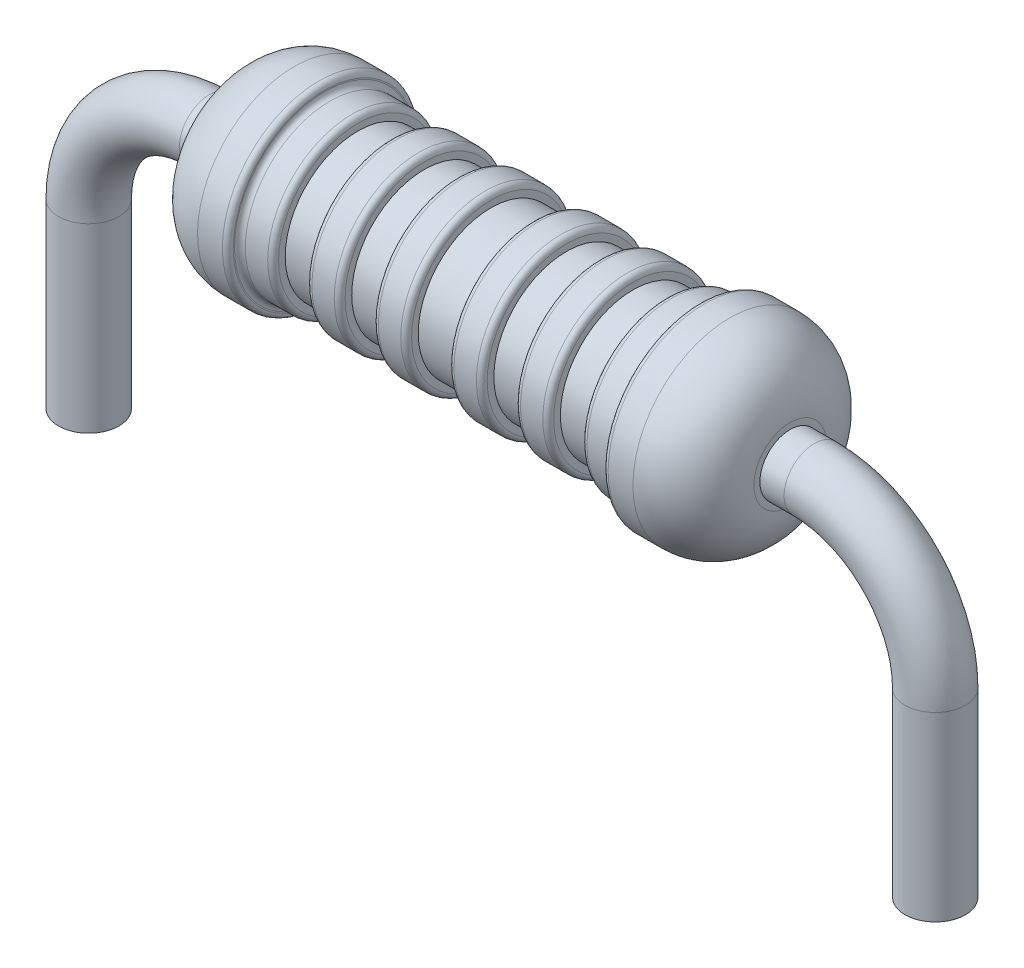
from build123d import *

# Parameters (mm, degrees)
SKETCH2_R = 0.5


with BuildPart() as part:
    # Sweep1: sweep along a path in Sketch3
    with BuildLine(Plane.XY) as sweep1_path:
        Line((7, 0), (7, 3))
        ThreePointArc((7, 3), (6.414213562, 4.414213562), (5, 5))
        Line((5, 5), (-5, 5))
        ThreePointArc((-5, 5), (-6.414213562, 4.414213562), (-7, 3))
        Line((-7, 3), (-7, 0))
    # Sketch2 → Sweep1 (sweep)
    with BuildSketch(Plane(origin=(0, 0, 0), x_dir=(1, 0, 0), z_dir=(0, 1, 0))):
        with Locations((-7, 0)):
            Circle(SKETCH2_R)
    sweep(path=sweep1_path.line)

    # Sketch4 → Revolve1 (revolve)
    with BuildSketch(Plane.XY, mode=Mode.PRIVATE) as revolve1_sk:
        with BuildLine():
            Line((-4.6, 5), (-4.6, 4.4))
            ThreePointArc((-4.6, 4.4), (-4.307106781, 3.692893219), (-3.6, 3.4))
            Line((-3.6, 3.4), (-3.19, 3.4))
            ThreePointArc((-3.19, 3.4), (-3.12636039, 3.42636039), (-3.1, 3.49))
            Line((-3.1, 3.49), (-3.1, 3.51))
            ThreePointArc((-3.1, 3.51), (-3.07363961, 3.57363961), (-3.01, 3.6))
            Line((-3.01, 3.6), (-2.64, 3.6))
            ThreePointArc((-2.64, 3.6), (-2.57636039, 3.62636039), (-2.55, 3.69))
            Line((-2.55, 3.69), (-2.55, 3.8))
            Line((-2.55, 3.8), (-2, 3.8))
            Line((-2, 3.8), (-2, 3.69))
            ThreePointArc((-2, 3.69), (-1.97363961, 3.62636039), (-1.91, 3.6))
            Line((-1.91, 3.6), (-1.54, 3.6))
            ThreePointArc((-1.54, 3.6), (-1.47636039, 3.62636039), (-1.45, 3.69))
            Line((-1.45, 3.69), (-1.45, 3.8))
            Line((-1.45, 3.8), (-0.9, 3.8))
            Line((-0.9, 3.8), (-0.9, 3.69))
            ThreePointArc((-0.9, 3.69), (-0.87363961, 3.62636039), (-0.81, 3.6))
            Line((-0.81, 3.6), (-0.44, 3.6))
            ThreePointArc((-0.44, 3.6), (-0.37636039, 3.62636039), (-0.35, 3.69))
            Line((-0.35, 3.69), (-0.35, 3.8))
            Line((-0.35, 3.8), (0.35, 3.8))
            Line((0.35, 3.8), (0.35, 3.69))
            ThreePointArc((0.35, 3.69), (0.37636039, 3.62636039), (0.44, 3.6))
            Line((0.44, 3.6), (0.81, 3.6))
            ThreePointArc((0.81, 3.6), (0.87363961, 3.62636039), (0.9, 3.69))
            Line((0.9, 3.69), (0.9, 3.8))
            Line((0.9, 3.8), (1.45, 3.8))
            Line((1.45, 3.8), (1.45, 3.69))
            ThreePointArc((1.45, 3.69), (1.47636039, 3.62636039), (1.54, 3.6))
            Line((1.54, 3.6), (1.91, 3.6))
            ThreePointArc((1.91, 3.6), (1.97363961, 3.62636039), (2, 3.69))
            Line((2, 3.69), (2, 3.8))
            Line((2, 3.8), (2.55, 3.8))
            Line((2.55, 3.8), (2.55, 3.69))
            ThreePointArc((2.55, 3.69), (2.57636039, 3.62636039), (2.64, 3.6))
            Line((2.64, 3.6), (3.01, 3.6))
            ThreePointArc((3.01, 3.6), (3.07363961, 3.57363961), (3.1, 3.51))
            Line((3.1, 3.51), (3.1, 3.49))
            ThreePointArc((3.1, 3.49), (3.12636039, 3.42636039), (3.19, 3.4))
            Line((3.19, 3.4), (3.6, 3.4))
            ThreePointArc((3.6, 3.4), (4.307106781, 3.692893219), (4.6, 4.4))
            Line((4.6, 4.4), (4.6, 5))
            Line((4.6, 5), (-4.6, 5))
        make_face()
    revolve(revolve1_sk.sketch.rotate(Axis((-4.6, 5, 0), (1, 0, 0)), 270), axis=Axis((-4.6, 5, 0), (1, 0, 0)))


solid = part.part
